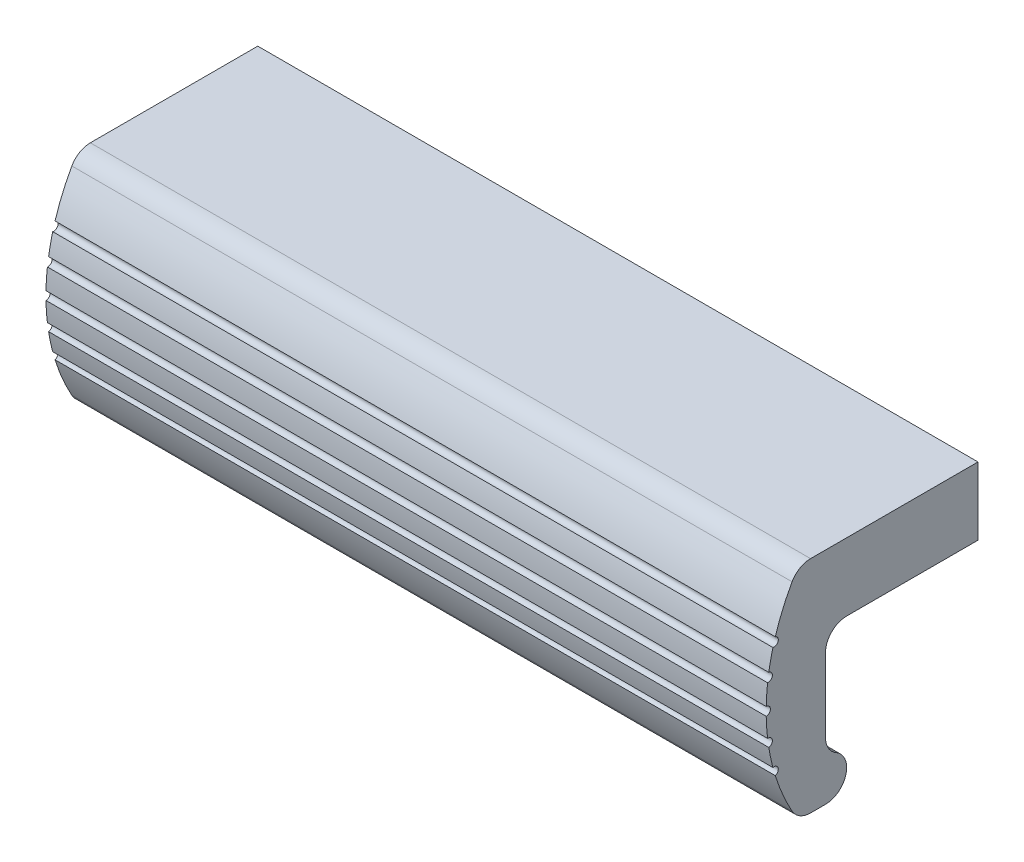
ISO-10303-21;
HEADER;
FILE_DESCRIPTION(('STEP AP214'),'2;1');
FILE_NAME('part.step','',(''),(''),'','','');
FILE_SCHEMA(('AUTOMOTIVE_DESIGN { 1 0 10303 214 1 1 1 1 }'));
ENDSEC;
DATA;
#1=APPLICATION_CONTEXT('core data for automotive mechanical design processes');
#2=APPLICATION_PROTOCOL_DEFINITION('international standard','automotive_design',2000,#1);
#3=PRODUCT_CONTEXT('',#1,'mechanical');
#4=PRODUCT('Part','Part','',(#3));
#5=PRODUCT_RELATED_PRODUCT_CATEGORY('part','',(#4));
#6=PRODUCT_DEFINITION_FORMATION('','',#4);
#7=PRODUCT_DEFINITION_CONTEXT('part definition',#1,'design');
#8=PRODUCT_DEFINITION('design','',#6,#7);
#9=PRODUCT_DEFINITION_SHAPE('','',#8);
#10=(LENGTH_UNIT() NAMED_UNIT(*) SI_UNIT(.MILLI.,.METRE.));
#11=(NAMED_UNIT(*) PLANE_ANGLE_UNIT() SI_UNIT($,.RADIAN.));
#12=(NAMED_UNIT(*) SI_UNIT($,.STERADIAN.) SOLID_ANGLE_UNIT());
#13=UNCERTAINTY_MEASURE_WITH_UNIT(LENGTH_MEASURE(1.E-05),#10,'distance_accuracy_value','');
#14=(GEOMETRIC_REPRESENTATION_CONTEXT(3) GLOBAL_UNCERTAINTY_ASSIGNED_CONTEXT((#13)) GLOBAL_UNIT_ASSIGNED_CONTEXT((#10,
#11,#12)) REPRESENTATION_CONTEXT('',''));
#15=CARTESIAN_POINT('',(0.,0.,0.));
#16=DIRECTION('',(0.,0.,1.));
#17=DIRECTION('',(1.,0.,0.));
#18=AXIS2_PLACEMENT_3D('',#15,#16,#17);
#19=CARTESIAN_POINT('',(-7.5,-4.,0.));
#20=DIRECTION('',(0.,1.,0.));
#21=DIRECTION('',(-1.,0.,0.));
#22=AXIS2_PLACEMENT_3D('',#19,#20,#21);
#23=PLANE('',#22);
#24=DIRECTION('',(1.,0.,0.));
#25=VECTOR('',#24,1.);
#26=CARTESIAN_POINT('',(-7.5,-4.,15.5));
#27=LINE('',#26,#25);
#28=CARTESIAN_POINT('',(-7.5,-4.,15.5));
#29=VERTEX_POINT('',#28);
#30=CARTESIAN_POINT('',(77.5,-4.,15.5));
#31=VERTEX_POINT('',#30);
#32=EDGE_CURVE('E9',#29,#31,#27,.T.);
#33=ORIENTED_EDGE('',*,*,#32,.F.);
#34=DIRECTION('',(0.,0.,1.));
#35=VECTOR('',#34,1.);
#36=CARTESIAN_POINT('',(-7.5,-4.,0.));
#37=LINE('',#36,#35);
#38=CARTESIAN_POINT('',(-7.5,-4.,0.));
#39=VERTEX_POINT('',#38);
#40=EDGE_CURVE('E232',#39,#29,#37,.T.);
#41=ORIENTED_EDGE('',*,*,#40,.F.);
#42=DIRECTION('',(1.,0.,0.));
#43=VECTOR('',#42,1.);
#44=CARTESIAN_POINT('',(-7.5,-4.,0.));
#45=LINE('',#44,#43);
#46=CARTESIAN_POINT('',(77.5,-4.,0.));
#47=VERTEX_POINT('',#46);
#48=EDGE_CURVE('E29',#39,#47,#45,.T.);
#49=ORIENTED_EDGE('',*,*,#48,.T.);
#50=DIRECTION('',(0.,0.,1.));
#51=VECTOR('',#50,1.);
#52=CARTESIAN_POINT('',(77.5,-4.,0.));
#53=LINE('',#52,#51);
#54=EDGE_CURVE('E167',#47,#31,#53,.T.);
#55=ORIENTED_EDGE('',*,*,#54,.T.);
#56=EDGE_LOOP('',(#33,#41,#49,#55));
#57=FACE_BOUND('',#56,.T.);
#58=ADVANCED_FACE('F14',(#57),#23,.F.);
#59=CARTESIAN_POINT('',(-7.5,-6.5,15.5));
#60=DIRECTION('',(1.,0.,0.));
#61=DIRECTION('',(0.,0.,-1.));
#62=AXIS2_PLACEMENT_3D('',#59,#60,#61);
#63=CYLINDRICAL_SURFACE('',#62,2.5);
#64=DIRECTION('',(1.,0.,0.));
#65=VECTOR('',#64,1.);
#66=CARTESIAN_POINT('',(-7.5,-6.5,18.));
#67=LINE('',#66,#65);
#68=CARTESIAN_POINT('',(-7.5,-6.5,18.));
#69=VERTEX_POINT('',#68);
#70=CARTESIAN_POINT('',(77.5,-6.5,18.));
#71=VERTEX_POINT('',#70);
#72=EDGE_CURVE('E22',#69,#71,#67,.T.);
#73=ORIENTED_EDGE('',*,*,#72,.F.);
#74=CARTESIAN_POINT('',(-7.5,-6.5,15.5));
#75=DIRECTION('',(-1.,0.,0.));
#76=DIRECTION('',(0.,0.,1.));
#77=AXIS2_PLACEMENT_3D('',#74,#75,#76);
#78=CIRCLE('',#77,2.5);
#79=EDGE_CURVE('E163',#69,#29,#78,.T.);
#80=ORIENTED_EDGE('',*,*,#79,.T.);
#81=ORIENTED_EDGE('',*,*,#32,.T.);
#82=CARTESIAN_POINT('',(77.5,-6.5,15.5));
#83=DIRECTION('',(-1.,0.,0.));
#84=DIRECTION('',(0.,0.,1.));
#85=AXIS2_PLACEMENT_3D('',#82,#83,#84);
#86=CIRCLE('',#85,2.5);
#87=EDGE_CURVE('E160',#71,#31,#86,.T.);
#88=ORIENTED_EDGE('',*,*,#87,.F.);
#89=EDGE_LOOP('',(#73,#80,#81,#88));
#90=FACE_BOUND('',#89,.T.);
#91=ADVANCED_FACE('F16',(#90),#63,.F.);
#92=CARTESIAN_POINT('',(-7.5,-6.5,18.));
#93=DIRECTION('',(0.,0.,1.));
#94=DIRECTION('',(1.,0.,0.));
#95=AXIS2_PLACEMENT_3D('',#92,#93,#94);
#96=PLANE('',#95);
#97=DIRECTION('',(1.,0.,0.));
#98=VECTOR('',#97,1.);
#99=CARTESIAN_POINT('',(-7.5,-15.1698729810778,18.));
#100=LINE('',#99,#98);
#101=CARTESIAN_POINT('',(-7.5,-15.1698729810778,18.));
#102=VERTEX_POINT('',#101);
#103=CARTESIAN_POINT('',(77.5,-15.1698729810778,18.));
#104=VERTEX_POINT('',#103);
#105=EDGE_CURVE('E324',#102,#104,#100,.T.);
#106=ORIENTED_EDGE('',*,*,#105,.F.);
#107=DIRECTION('',(0.,-1.,0.));
#108=VECTOR('',#107,1.);
#109=CARTESIAN_POINT('',(-7.5,-6.5,18.));
#110=LINE('',#109,#108);
#111=EDGE_CURVE('E235',#69,#102,#110,.T.);
#112=ORIENTED_EDGE('',*,*,#111,.F.);
#113=ORIENTED_EDGE('',*,*,#72,.T.);
#114=DIRECTION('',(0.,-1.,0.));
#115=VECTOR('',#114,1.);
#116=CARTESIAN_POINT('',(77.5,-6.5,18.));
#117=LINE('',#116,#115);
#118=EDGE_CURVE('E175',#71,#104,#117,.T.);
#119=ORIENTED_EDGE('',*,*,#118,.T.);
#120=EDGE_LOOP('',(#106,#112,#113,#119));
#121=FACE_BOUND('',#120,.T.);
#122=ADVANCED_FACE('F327',(#121),#96,.F.);
#123=CARTESIAN_POINT('',(-7.5,-15.1698729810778,15.5));
#124=DIRECTION('',(1.,0.,0.));
#125=DIRECTION('',(0.,0.,-1.));
#126=AXIS2_PLACEMENT_3D('',#123,#124,#125);
#127=CYLINDRICAL_SURFACE('',#126,2.5);
#128=DIRECTION('',(1.,0.,0.));
#129=VECTOR('',#128,1.);
#130=CARTESIAN_POINT('',(-7.5,-17.334936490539,16.75));
#131=LINE('',#130,#129);
#132=CARTESIAN_POINT('',(-7.5,-17.334936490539,16.75));
#133=VERTEX_POINT('',#132);
#134=CARTESIAN_POINT('',(77.5,-17.334936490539,16.75));
#135=VERTEX_POINT('',#134);
#136=EDGE_CURVE('E322',#133,#135,#131,.T.);
#137=ORIENTED_EDGE('',*,*,#136,.F.);
#138=CARTESIAN_POINT('',(-7.5,-15.1698729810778,15.5));
#139=DIRECTION('',(-1.,0.,0.));
#140=DIRECTION('',(0.,0.,1.));
#141=AXIS2_PLACEMENT_3D('',#138,#139,#140);
#142=CIRCLE('',#141,2.5);
#143=EDGE_CURVE('E238',#133,#102,#142,.T.);
#144=ORIENTED_EDGE('',*,*,#143,.T.);
#145=ORIENTED_EDGE('',*,*,#105,.T.);
#146=CARTESIAN_POINT('',(77.5,-15.1698729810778,15.5));
#147=DIRECTION('',(-1.,0.,0.));
#148=DIRECTION('',(0.,0.,1.));
#149=AXIS2_PLACEMENT_3D('',#146,#147,#148);
#150=CIRCLE('',#149,2.5);
#151=EDGE_CURVE('E177',#135,#104,#150,.T.);
#152=ORIENTED_EDGE('',*,*,#151,.F.);
#153=EDGE_LOOP('',(#137,#144,#145,#152));
#154=FACE_BOUND('',#153,.T.);
#155=ADVANCED_FACE('F396',(#154),#127,.F.);
#156=CARTESIAN_POINT('',(-7.5,-19.5,18.));
#157=DIRECTION('',(1.,0.,0.));
#158=DIRECTION('',(0.,0.,-1.));
#159=AXIS2_PLACEMENT_3D('',#156,#157,#158);
#160=CYLINDRICAL_SURFACE('',#159,2.5);
#161=DIRECTION('',(1.,0.,0.));
#162=VECTOR('',#161,1.);
#163=CARTESIAN_POINT('',(-7.5,-22.,18.));
#164=LINE('',#163,#162);
#165=CARTESIAN_POINT('',(-7.5,-22.,18.));
#166=VERTEX_POINT('',#165);
#167=CARTESIAN_POINT('',(77.5,-22.,18.));
#168=VERTEX_POINT('',#167);
#169=EDGE_CURVE('E320',#166,#168,#164,.T.);
#170=ORIENTED_EDGE('',*,*,#169,.F.);
#171=CARTESIAN_POINT('',(-7.5,-19.5,18.));
#172=DIRECTION('',(-1.,0.,0.));
#173=DIRECTION('',(0.,0.,1.));
#174=AXIS2_PLACEMENT_3D('',#171,#172,#173);
#175=CIRCLE('',#174,2.5);
#176=EDGE_CURVE('E241',#133,#166,#175,.T.);
#177=ORIENTED_EDGE('',*,*,#176,.F.);
#178=ORIENTED_EDGE('',*,*,#136,.T.);
#179=CARTESIAN_POINT('',(77.5,-19.5,18.));
#180=DIRECTION('',(-1.,0.,0.));
#181=DIRECTION('',(0.,0.,1.));
#182=AXIS2_PLACEMENT_3D('',#179,#180,#181);
#183=CIRCLE('',#182,2.5);
#184=EDGE_CURVE('E182',#135,#168,#183,.T.);
#185=ORIENTED_EDGE('',*,*,#184,.T.);
#186=EDGE_LOOP('',(#170,#177,#178,#185));
#187=FACE_BOUND('',#186,.T.);
#188=ADVANCED_FACE('F393',(#187),#160,.T.);
#189=CARTESIAN_POINT('',(-7.5,-22.,18.));
#190=DIRECTION('',(0.,1.,0.));
#191=DIRECTION('',(-1.,0.,0.));
#192=AXIS2_PLACEMENT_3D('',#189,#190,#191);
#193=PLANE('',#192);
#194=DIRECTION('',(1.,0.,0.));
#195=VECTOR('',#194,1.);
#196=CARTESIAN_POINT('',(-7.5,-22.,19.7616630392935));
#197=LINE('',#196,#195);
#198=CARTESIAN_POINT('',(-7.5,-22.,19.7616630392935));
#199=VERTEX_POINT('',#198);
#200=CARTESIAN_POINT('',(77.5,-22.,19.7616630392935));
#201=VERTEX_POINT('',#200);
#202=EDGE_CURVE('E318',#199,#201,#197,.T.);
#203=ORIENTED_EDGE('',*,*,#202,.F.);
#204=DIRECTION('',(0.,0.,1.));
#205=VECTOR('',#204,1.);
#206=CARTESIAN_POINT('',(-7.5,-22.,18.));
#207=LINE('',#206,#205);
#208=EDGE_CURVE('E244',#166,#199,#207,.T.);
#209=ORIENTED_EDGE('',*,*,#208,.F.);
#210=ORIENTED_EDGE('',*,*,#169,.T.);
#211=DIRECTION('',(0.,0.,1.));
#212=VECTOR('',#211,1.);
#213=CARTESIAN_POINT('',(77.5,-22.,18.));
#214=LINE('',#213,#212);
#215=EDGE_CURVE('E185',#168,#201,#214,.T.);
#216=ORIENTED_EDGE('',*,*,#215,.T.);
#217=EDGE_LOOP('',(#203,#209,#210,#216));
#218=FACE_BOUND('',#217,.T.);
#219=ADVANCED_FACE('F390',(#218),#193,.F.);
#220=CARTESIAN_POINT('',(-7.5,-19.5,19.7616630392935));
#221=DIRECTION('',(1.,0.,0.));
#222=DIRECTION('',(0.,0.,-1.));
#223=AXIS2_PLACEMENT_3D('',#220,#221,#222);
#224=CYLINDRICAL_SURFACE('',#223,2.5);
#225=DIRECTION('',(1.,0.,0.));
#226=VECTOR('',#225,1.);
#227=CARTESIAN_POINT('',(-7.5,-20.720930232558,21.943251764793));
#228=LINE('',#227,#226);
#229=CARTESIAN_POINT('',(-7.5,-20.720930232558,21.943251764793));
#230=VERTEX_POINT('',#229);
#231=CARTESIAN_POINT('',(77.5,-20.720930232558,21.943251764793));
#232=VERTEX_POINT('',#231);
#233=EDGE_CURVE('E316',#230,#232,#228,.T.);
#234=ORIENTED_EDGE('',*,*,#233,.F.);
#235=CARTESIAN_POINT('',(-7.5,-19.5,19.7616630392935));
#236=DIRECTION('',(-1.,0.,0.));
#237=DIRECTION('',(0.,0.,1.));
#238=AXIS2_PLACEMENT_3D('',#235,#236,#237);
#239=CIRCLE('',#238,2.5);
#240=EDGE_CURVE('E247',#199,#230,#239,.T.);
#241=ORIENTED_EDGE('',*,*,#240,.F.);
#242=ORIENTED_EDGE('',*,*,#202,.T.);
#243=CARTESIAN_POINT('',(77.5,-19.5,19.7616630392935));
#244=DIRECTION('',(-1.,0.,0.));
#245=DIRECTION('',(0.,0.,1.));
#246=AXIS2_PLACEMENT_3D('',#243,#244,#245);
#247=CIRCLE('',#246,2.5);
#248=EDGE_CURVE('E188',#201,#232,#247,.T.);
#249=ORIENTED_EDGE('',*,*,#248,.T.);
#250=EDGE_LOOP('',(#234,#241,#242,#249));
#251=FACE_BOUND('',#250,.T.);
#252=ADVANCED_FACE('F386',(#251),#224,.T.);
#253=CARTESIAN_POINT('',(-7.5,-9.,1.));
#254=DIRECTION('',(1.,0.,0.));
#255=DIRECTION('',(0.,0.,-1.));
#256=AXIS2_PLACEMENT_3D('',#253,#254,#255);
#257=CYLINDRICAL_SURFACE('',#256,24.);
#258=DIRECTION('',(1.,0.,0.));
#259=VECTOR('',#258,1.);
#260=CARTESIAN_POINT('',(-7.5,-16.094465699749,23.9274629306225));
#261=LINE('',#260,#259);
#262=CARTESIAN_POINT('',(-7.5,-16.094465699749,23.9274629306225));
#263=VERTEX_POINT('',#262);
#264=CARTESIAN_POINT('',(77.5,-16.094465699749,23.9274629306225));
#265=VERTEX_POINT('',#264);
#266=EDGE_CURVE('E314',#263,#265,#261,.T.);
#267=ORIENTED_EDGE('',*,*,#266,.F.);
#268=CARTESIAN_POINT('',(-7.5,-9.,1.));
#269=DIRECTION('',(-1.,0.,0.));
#270=DIRECTION('',(0.,0.,1.));
#271=AXIS2_PLACEMENT_3D('',#268,#269,#270);
#272=CIRCLE('',#271,24.);
#273=EDGE_CURVE('E250',#230,#263,#272,.T.);
#274=ORIENTED_EDGE('',*,*,#273,.F.);
#275=ORIENTED_EDGE('',*,*,#233,.T.);
#276=CARTESIAN_POINT('',(77.5,-9.,1.));
#277=DIRECTION('',(-1.,0.,0.));
#278=DIRECTION('',(0.,0.,1.));
#279=AXIS2_PLACEMENT_3D('',#276,#277,#278);
#280=CIRCLE('',#279,24.);
#281=EDGE_CURVE('E191',#232,#265,#280,.T.);
#282=ORIENTED_EDGE('',*,*,#281,.T.);
#283=EDGE_LOOP('',(#267,#274,#275,#282));
#284=FACE_BOUND('',#283,.T.);
#285=ADVANCED_FACE('F381',(#284),#257,.T.);
#286=CARTESIAN_POINT('',(-7.5,-15.615296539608,24.0702807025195));
#287=DIRECTION('',(1.,0.,0.));
#288=DIRECTION('',(0.,0.,-1.));
#289=AXIS2_PLACEMENT_3D('',#286,#287,#288);
#290=CYLINDRICAL_SURFACE('',#289,0.5);
#291=DIRECTION('',(1.,0.,0.));
#292=VECTOR('',#291,1.);
#293=CARTESIAN_POINT('',(-7.5,-15.1332561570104,24.2030853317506));
#294=LINE('',#293,#292);
#295=CARTESIAN_POINT('',(-7.5,-15.1332561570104,24.2030853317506));
#296=VERTEX_POINT('',#295);
#297=CARTESIAN_POINT('',(77.5,-15.1332561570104,24.2030853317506));
#298=VERTEX_POINT('',#297);
#299=EDGE_CURVE('E312',#296,#298,#294,.T.);
#300=ORIENTED_EDGE('',*,*,#299,.F.);
#301=CARTESIAN_POINT('',(-7.5,-15.615296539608,24.0702807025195));
#302=DIRECTION('',(-1.,0.,0.));
#303=DIRECTION('',(0.,0.,1.));
#304=AXIS2_PLACEMENT_3D('',#301,#302,#303);
#305=CIRCLE('',#304,0.5);
#306=EDGE_CURVE('E253',#296,#263,#305,.T.);
#307=ORIENTED_EDGE('',*,*,#306,.T.);
#308=ORIENTED_EDGE('',*,*,#266,.T.);
#309=CARTESIAN_POINT('',(77.5,-15.615296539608,24.0702807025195));
#310=DIRECTION('',(-1.,0.,0.));
#311=DIRECTION('',(0.,0.,1.));
#312=AXIS2_PLACEMENT_3D('',#309,#310,#311);
#313=CIRCLE('',#312,0.5);
#314=EDGE_CURVE('E194',#298,#265,#313,.T.);
#315=ORIENTED_EDGE('',*,*,#314,.F.);
#316=EDGE_LOOP('',(#300,#307,#308,#315));
#317=FACE_BOUND('',#316,.T.);
#318=ADVANCED_FACE('F378',(#317),#290,.F.);
#319=CARTESIAN_POINT('',(-7.5,-9.,1.));
#320=DIRECTION('',(1.,0.,0.));
#321=DIRECTION('',(0.,0.,-1.));
#322=AXIS2_PLACEMENT_3D('',#319,#320,#321);
#323=CYLINDRICAL_SURFACE('',#322,24.);
#324=DIRECTION('',(1.,0.,0.));
#325=VECTOR('',#324,1.);
#326=CARTESIAN_POINT('',(-7.5,-12.8345367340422,24.6916932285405));
#327=LINE('',#326,#325);
#328=CARTESIAN_POINT('',(-7.5,-12.8345367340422,24.6916932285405));
#329=VERTEX_POINT('',#328);
#330=CARTESIAN_POINT('',(77.5,-12.8345367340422,24.6916932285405));
#331=VERTEX_POINT('',#330);
#332=EDGE_CURVE('E310',#329,#331,#327,.T.);
#333=ORIENTED_EDGE('',*,*,#332,.F.);
#334=CARTESIAN_POINT('',(-7.5,-9.,1.));
#335=DIRECTION('',(-1.,0.,0.));
#336=DIRECTION('',(0.,0.,1.));
#337=AXIS2_PLACEMENT_3D('',#334,#335,#336);
#338=CIRCLE('',#337,24.);
#339=EDGE_CURVE('E256',#296,#329,#338,.T.);
#340=ORIENTED_EDGE('',*,*,#339,.F.);
#341=ORIENTED_EDGE('',*,*,#299,.T.);
#342=CARTESIAN_POINT('',(77.5,-9.,1.));
#343=DIRECTION('',(-1.,0.,0.));
#344=DIRECTION('',(0.,0.,1.));
#345=AXIS2_PLACEMENT_3D('',#342,#343,#344);
#346=CIRCLE('',#345,24.);
#347=EDGE_CURVE('E197',#298,#331,#346,.T.);
#348=ORIENTED_EDGE('',*,*,#347,.T.);
#349=EDGE_LOOP('',(#333,#340,#341,#348));
#350=FACE_BOUND('',#349,.T.);
#351=ADVANCED_FACE('F374',(#350),#323,.T.);
#352=CARTESIAN_POINT('',(-7.5,-12.3401544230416,24.7664336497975));
#353=DIRECTION('',(1.,0.,0.));
#354=DIRECTION('',(0.,0.,-1.));
#355=AXIS2_PLACEMENT_3D('',#352,#353,#354);
#356=CYLINDRICAL_SURFACE('',#355,0.5);
#357=DIRECTION('',(1.,0.,0.));
#358=VECTOR('',#357,1.);
#359=CARTESIAN_POINT('',(-7.5,-11.8443223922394,24.830858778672));
#360=LINE('',#359,#358);
#361=CARTESIAN_POINT('',(-7.5,-11.8443223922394,24.830858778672));
#362=VERTEX_POINT('',#361);
#363=CARTESIAN_POINT('',(77.5,-11.8443223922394,24.830858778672));
#364=VERTEX_POINT('',#363);
#365=EDGE_CURVE('E308',#362,#364,#360,.T.);
#366=ORIENTED_EDGE('',*,*,#365,.F.);
#367=CARTESIAN_POINT('',(-7.5,-12.3401544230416,24.7664336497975));
#368=DIRECTION('',(-1.,0.,0.));
#369=DIRECTION('',(0.,0.,1.));
#370=AXIS2_PLACEMENT_3D('',#367,#368,#369);
#371=CIRCLE('',#370,0.5);
#372=EDGE_CURVE('E259',#362,#329,#371,.T.);
#373=ORIENTED_EDGE('',*,*,#372,.T.);
#374=ORIENTED_EDGE('',*,*,#332,.T.);
#375=CARTESIAN_POINT('',(77.5,-12.3401544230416,24.7664336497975));
#376=DIRECTION('',(-1.,0.,0.));
#377=DIRECTION('',(0.,0.,1.));
#378=AXIS2_PLACEMENT_3D('',#375,#376,#377);
#379=CIRCLE('',#378,0.5);
#380=EDGE_CURVE('E200',#364,#331,#379,.T.);
#381=ORIENTED_EDGE('',*,*,#380,.F.);
#382=EDGE_LOOP('',(#366,#373,#374,#381));
#383=FACE_BOUND('',#382,.T.);
#384=ADVANCED_FACE('F369',(#383),#356,.F.);
#385=CARTESIAN_POINT('',(-7.5,-9.,1.));
#386=DIRECTION('',(1.,0.,0.));
#387=DIRECTION('',(0.,0.,-1.));
#388=AXIS2_PLACEMENT_3D('',#385,#386,#387);
#389=CYLINDRICAL_SURFACE('',#388,24.);
#390=DIRECTION('',(1.,0.,0.));
#391=VECTOR('',#390,1.);
#392=CARTESIAN_POINT('',(-7.5,-9.49997287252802,24.9947916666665));
#393=LINE('',#392,#391);
#394=CARTESIAN_POINT('',(-7.5,-9.49997287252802,24.9947916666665));
#395=VERTEX_POINT('',#394);
#396=CARTESIAN_POINT('',(77.5,-9.49997287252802,24.9947916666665));
#397=VERTEX_POINT('',#396);
#398=EDGE_CURVE('E306',#395,#397,#393,.T.);
#399=ORIENTED_EDGE('',*,*,#398,.F.);
#400=CARTESIAN_POINT('',(-7.5,-9.,1.));
#401=DIRECTION('',(-1.,0.,0.));
#402=DIRECTION('',(0.,0.,1.));
#403=AXIS2_PLACEMENT_3D('',#400,#401,#402);
#404=CIRCLE('',#403,24.);
#405=EDGE_CURVE('E262',#362,#395,#404,.T.);
#406=ORIENTED_EDGE('',*,*,#405,.F.);
#407=ORIENTED_EDGE('',*,*,#365,.T.);
#408=CARTESIAN_POINT('',(77.5,-9.,1.));
#409=DIRECTION('',(-1.,0.,0.));
#410=DIRECTION('',(0.,0.,1.));
#411=AXIS2_PLACEMENT_3D('',#408,#409,#410);
#412=CIRCLE('',#411,24.);
#413=EDGE_CURVE('E203',#364,#397,#412,.T.);
#414=ORIENTED_EDGE('',*,*,#413,.T.);
#415=EDGE_LOOP('',(#399,#406,#407,#414));
#416=FACE_BOUND('',#415,.T.);
#417=ADVANCED_FACE('F365',(#416),#389,.T.);
#418=CARTESIAN_POINT('',(-7.5,-9.,25.));
#419=DIRECTION('',(1.,0.,0.));
#420=DIRECTION('',(0.,0.,-1.));
#421=AXIS2_PLACEMENT_3D('',#418,#419,#420);
#422=CYLINDRICAL_SURFACE('',#421,0.500000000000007);
#423=DIRECTION('',(1.,0.,0.));
#424=VECTOR('',#423,1.);
#425=CARTESIAN_POINT('',(-7.5,-8.50002712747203,24.9947916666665));
#426=LINE('',#425,#424);
#427=CARTESIAN_POINT('',(-7.5,-8.50002712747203,24.9947916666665));
#428=VERTEX_POINT('',#427);
#429=CARTESIAN_POINT('',(77.5,-8.50002712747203,24.9947916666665));
#430=VERTEX_POINT('',#429);
#431=EDGE_CURVE('E304',#428,#430,#426,.T.);
#432=ORIENTED_EDGE('',*,*,#431,.F.);
#433=CARTESIAN_POINT('',(-7.5,-9.,25.));
#434=DIRECTION('',(-1.,0.,0.));
#435=DIRECTION('',(0.,0.,1.));
#436=AXIS2_PLACEMENT_3D('',#433,#434,#435);
#437=CIRCLE('',#436,0.500000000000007);
#438=EDGE_CURVE('E265',#428,#395,#437,.T.);
#439=ORIENTED_EDGE('',*,*,#438,.T.);
#440=ORIENTED_EDGE('',*,*,#398,.T.);
#441=CARTESIAN_POINT('',(77.5,-9.,25.));
#442=DIRECTION('',(-1.,0.,0.));
#443=DIRECTION('',(0.,0.,1.));
#444=AXIS2_PLACEMENT_3D('',#441,#442,#443);
#445=CIRCLE('',#444,0.500000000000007);
#446=EDGE_CURVE('E206',#430,#397,#445,.T.);
#447=ORIENTED_EDGE('',*,*,#446,.F.);
#448=EDGE_LOOP('',(#432,#439,#440,#447));
#449=FACE_BOUND('',#448,.T.);
#450=ADVANCED_FACE('F361',(#449),#422,.F.);
#451=CARTESIAN_POINT('',(-7.5,-9.,1.));
#452=DIRECTION('',(1.,0.,0.));
#453=DIRECTION('',(0.,0.,-1.));
#454=AXIS2_PLACEMENT_3D('',#451,#452,#453);
#455=CYLINDRICAL_SURFACE('',#454,24.);
#456=DIRECTION('',(1.,0.,0.));
#457=VECTOR('',#456,1.);
#458=CARTESIAN_POINT('',(-7.5,-6.15567760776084,24.830858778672));
#459=LINE('',#458,#457);
#460=CARTESIAN_POINT('',(-7.5,-6.15567760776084,24.830858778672));
#461=VERTEX_POINT('',#460);
#462=CARTESIAN_POINT('',(77.5,-6.15567760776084,24.830858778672));
#463=VERTEX_POINT('',#462);
#464=EDGE_CURVE('E302',#461,#463,#459,.T.);
#465=ORIENTED_EDGE('',*,*,#464,.F.);
#466=CARTESIAN_POINT('',(-7.5,-9.,1.));
#467=DIRECTION('',(-1.,0.,0.));
#468=DIRECTION('',(0.,0.,1.));
#469=AXIS2_PLACEMENT_3D('',#466,#467,#468);
#470=CIRCLE('',#469,24.);
#471=EDGE_CURVE('E268',#428,#461,#470,.T.);
#472=ORIENTED_EDGE('',*,*,#471,.F.);
#473=ORIENTED_EDGE('',*,*,#431,.T.);
#474=CARTESIAN_POINT('',(77.5,-9.,1.));
#475=DIRECTION('',(-1.,0.,0.));
#476=DIRECTION('',(0.,0.,1.));
#477=AXIS2_PLACEMENT_3D('',#474,#475,#476);
#478=CIRCLE('',#477,24.);
#479=EDGE_CURVE('E209',#430,#463,#478,.T.);
#480=ORIENTED_EDGE('',*,*,#479,.T.);
#481=EDGE_LOOP('',(#465,#472,#473,#480));
#482=FACE_BOUND('',#481,.T.);
#483=ADVANCED_FACE('F357',(#482),#455,.T.);
#484=CARTESIAN_POINT('',(-7.5,-5.65984557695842,24.7664336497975));
#485=DIRECTION('',(1.,0.,0.));
#486=DIRECTION('',(0.,0.,-1.));
#487=AXIS2_PLACEMENT_3D('',#484,#485,#486);
#488=CYLINDRICAL_SURFACE('',#487,0.499999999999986);
#489=DIRECTION('',(1.,0.,0.));
#490=VECTOR('',#489,1.);
#491=CARTESIAN_POINT('',(-7.5,-5.16546326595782,24.6916932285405));
#492=LINE('',#491,#490);
#493=CARTESIAN_POINT('',(-7.5,-5.16546326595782,24.6916932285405));
#494=VERTEX_POINT('',#493);
#495=CARTESIAN_POINT('',(77.5,-5.16546326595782,24.6916932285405));
#496=VERTEX_POINT('',#495);
#497=EDGE_CURVE('E300',#494,#496,#492,.T.);
#498=ORIENTED_EDGE('',*,*,#497,.F.);
#499=CARTESIAN_POINT('',(-7.5,-5.65984557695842,24.7664336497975));
#500=DIRECTION('',(-1.,0.,0.));
#501=DIRECTION('',(0.,0.,1.));
#502=AXIS2_PLACEMENT_3D('',#499,#500,#501);
#503=CIRCLE('',#502,0.499999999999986);
#504=EDGE_CURVE('E271',#494,#461,#503,.T.);
#505=ORIENTED_EDGE('',*,*,#504,.T.);
#506=ORIENTED_EDGE('',*,*,#464,.T.);
#507=CARTESIAN_POINT('',(77.5,-5.65984557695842,24.7664336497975));
#508=DIRECTION('',(-1.,0.,0.));
#509=DIRECTION('',(0.,0.,1.));
#510=AXIS2_PLACEMENT_3D('',#507,#508,#509);
#511=CIRCLE('',#510,0.499999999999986);
#512=EDGE_CURVE('E212',#496,#463,#511,.T.);
#513=ORIENTED_EDGE('',*,*,#512,.F.);
#514=EDGE_LOOP('',(#498,#505,#506,#513));
#515=FACE_BOUND('',#514,.T.);
#516=ADVANCED_FACE('F354',(#515),#488,.F.);
#517=CARTESIAN_POINT('',(-7.5,-9.,1.));
#518=DIRECTION('',(1.,0.,0.));
#519=DIRECTION('',(0.,0.,-1.));
#520=AXIS2_PLACEMENT_3D('',#517,#518,#519);
#521=CYLINDRICAL_SURFACE('',#520,24.);
#522=DIRECTION('',(1.,0.,0.));
#523=VECTOR('',#522,1.);
#524=CARTESIAN_POINT('',(-7.5,-2.8667438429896,24.2030853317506));
#525=LINE('',#524,#523);
#526=CARTESIAN_POINT('',(-7.5,-2.8667438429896,24.2030853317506));
#527=VERTEX_POINT('',#526);
#528=CARTESIAN_POINT('',(77.5,-2.8667438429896,24.2030853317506));
#529=VERTEX_POINT('',#528);
#530=EDGE_CURVE('E298',#527,#529,#525,.T.);
#531=ORIENTED_EDGE('',*,*,#530,.F.);
#532=CARTESIAN_POINT('',(-7.5,-9.,1.));
#533=DIRECTION('',(-1.,0.,0.));
#534=DIRECTION('',(0.,0.,1.));
#535=AXIS2_PLACEMENT_3D('',#532,#533,#534);
#536=CIRCLE('',#535,24.);
#537=EDGE_CURVE('E274',#494,#527,#536,.T.);
#538=ORIENTED_EDGE('',*,*,#537,.F.);
#539=ORIENTED_EDGE('',*,*,#497,.T.);
#540=CARTESIAN_POINT('',(77.5,-9.,1.));
#541=DIRECTION('',(-1.,0.,0.));
#542=DIRECTION('',(0.,0.,1.));
#543=AXIS2_PLACEMENT_3D('',#540,#541,#542);
#544=CIRCLE('',#543,24.);
#545=EDGE_CURVE('E215',#496,#529,#544,.T.);
#546=ORIENTED_EDGE('',*,*,#545,.T.);
#547=EDGE_LOOP('',(#531,#538,#539,#546));
#548=FACE_BOUND('',#547,.T.);
#549=ADVANCED_FACE('F350',(#548),#521,.T.);
#550=CARTESIAN_POINT('',(-7.5,-2.38470346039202,24.0702807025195));
#551=DIRECTION('',(1.,0.,0.));
#552=DIRECTION('',(0.,0.,-1.));
#553=AXIS2_PLACEMENT_3D('',#550,#551,#552);
#554=CYLINDRICAL_SURFACE('',#553,0.500000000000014);
#555=DIRECTION('',(1.,0.,0.));
#556=VECTOR('',#555,1.);
#557=CARTESIAN_POINT('',(-7.5,-1.90553430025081,23.9274629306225));
#558=LINE('',#557,#556);
#559=CARTESIAN_POINT('',(-7.5,-1.90553430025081,23.9274629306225));
#560=VERTEX_POINT('',#559);
#561=CARTESIAN_POINT('',(77.5,-1.90553430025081,23.9274629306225));
#562=VERTEX_POINT('',#561);
#563=EDGE_CURVE('E296',#560,#562,#558,.T.);
#564=ORIENTED_EDGE('',*,*,#563,.F.);
#565=CARTESIAN_POINT('',(-7.5,-2.38470346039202,24.0702807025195));
#566=DIRECTION('',(-1.,0.,0.));
#567=DIRECTION('',(0.,0.,1.));
#568=AXIS2_PLACEMENT_3D('',#565,#566,#567);
#569=CIRCLE('',#568,0.500000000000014);
#570=EDGE_CURVE('E277',#560,#527,#569,.T.);
#571=ORIENTED_EDGE('',*,*,#570,.T.);
#572=ORIENTED_EDGE('',*,*,#530,.T.);
#573=CARTESIAN_POINT('',(77.5,-2.38470346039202,24.0702807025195));
#574=DIRECTION('',(-1.,0.,0.));
#575=DIRECTION('',(0.,0.,1.));
#576=AXIS2_PLACEMENT_3D('',#573,#574,#575);
#577=CIRCLE('',#576,0.500000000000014);
#578=EDGE_CURVE('E218',#562,#529,#577,.T.);
#579=ORIENTED_EDGE('',*,*,#578,.F.);
#580=EDGE_LOOP('',(#564,#571,#572,#579));
#581=FACE_BOUND('',#580,.T.);
#582=ADVANCED_FACE('F345',(#581),#554,.F.);
#583=CARTESIAN_POINT('',(-7.5,-9.,1.));
#584=DIRECTION('',(1.,0.,0.));
#585=DIRECTION('',(0.,0.,-1.));
#586=AXIS2_PLACEMENT_3D('',#583,#584,#585);
#587=CYLINDRICAL_SURFACE('',#586,24.);
#588=DIRECTION('',(1.,0.,0.));
#589=VECTOR('',#588,1.);
#590=CARTESIAN_POINT('',(-7.5,2.72093023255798,21.943251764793));
#591=LINE('',#590,#589);
#592=CARTESIAN_POINT('',(-7.5,2.72093023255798,21.943251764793));
#593=VERTEX_POINT('',#592);
#594=CARTESIAN_POINT('',(77.5,2.72093023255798,21.943251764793));
#595=VERTEX_POINT('',#594);
#596=EDGE_CURVE('E294',#593,#595,#591,.T.);
#597=ORIENTED_EDGE('',*,*,#596,.F.);
#598=CARTESIAN_POINT('',(-7.5,-9.,1.));
#599=DIRECTION('',(-1.,0.,0.));
#600=DIRECTION('',(0.,0.,1.));
#601=AXIS2_PLACEMENT_3D('',#598,#599,#600);
#602=CIRCLE('',#601,24.);
#603=EDGE_CURVE('E280',#560,#593,#602,.T.);
#604=ORIENTED_EDGE('',*,*,#603,.F.);
#605=ORIENTED_EDGE('',*,*,#563,.T.);
#606=CARTESIAN_POINT('',(77.5,-9.,1.));
#607=DIRECTION('',(-1.,0.,0.));
#608=DIRECTION('',(0.,0.,1.));
#609=AXIS2_PLACEMENT_3D('',#606,#607,#608);
#610=CIRCLE('',#609,24.);
#611=EDGE_CURVE('E221',#562,#595,#610,.T.);
#612=ORIENTED_EDGE('',*,*,#611,.T.);
#613=EDGE_LOOP('',(#597,#604,#605,#612));
#614=FACE_BOUND('',#613,.T.);
#615=ADVANCED_FACE('F341',(#614),#587,.T.);
#616=CARTESIAN_POINT('',(-7.5,1.5,19.7616630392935));
#617=DIRECTION('',(1.,0.,0.));
#618=DIRECTION('',(0.,0.,-1.));
#619=AXIS2_PLACEMENT_3D('',#616,#617,#618);
#620=CYLINDRICAL_SURFACE('',#619,2.5);
#621=DIRECTION('',(1.,0.,0.));
#622=VECTOR('',#621,1.);
#623=CARTESIAN_POINT('',(-7.5,4.,19.7616630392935));
#624=LINE('',#623,#622);
#625=CARTESIAN_POINT('',(-7.5,4.,19.7616630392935));
#626=VERTEX_POINT('',#625);
#627=CARTESIAN_POINT('',(77.5,4.,19.7616630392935));
#628=VERTEX_POINT('',#627);
#629=EDGE_CURVE('E292',#626,#628,#624,.T.);
#630=ORIENTED_EDGE('',*,*,#629,.F.);
#631=CARTESIAN_POINT('',(-7.5,1.5,19.7616630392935));
#632=DIRECTION('',(-1.,0.,0.));
#633=DIRECTION('',(0.,0.,1.));
#634=AXIS2_PLACEMENT_3D('',#631,#632,#633);
#635=CIRCLE('',#634,2.5);
#636=EDGE_CURVE('E283',#593,#626,#635,.T.);
#637=ORIENTED_EDGE('',*,*,#636,.F.);
#638=ORIENTED_EDGE('',*,*,#596,.T.);
#639=CARTESIAN_POINT('',(77.5,1.5,19.7616630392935));
#640=DIRECTION('',(-1.,0.,0.));
#641=DIRECTION('',(0.,0.,1.));
#642=AXIS2_PLACEMENT_3D('',#639,#640,#641);
#643=CIRCLE('',#642,2.5);
#644=EDGE_CURVE('E224',#595,#628,#643,.T.);
#645=ORIENTED_EDGE('',*,*,#644,.T.);
#646=EDGE_LOOP('',(#630,#637,#638,#645));
#647=FACE_BOUND('',#646,.T.);
#648=ADVANCED_FACE('F337',(#647),#620,.T.);
#649=CARTESIAN_POINT('',(-7.5,4.,0.));
#650=DIRECTION('',(0.,1.,0.));
#651=DIRECTION('',(-1.,0.,0.));
#652=AXIS2_PLACEMENT_3D('',#649,#650,#651);
#653=PLANE('',#652);
#654=DIRECTION('',(1.,0.,0.));
#655=VECTOR('',#654,1.);
#656=CARTESIAN_POINT('',(-7.5,4.,0.));
#657=LINE('',#656,#655);
#658=CARTESIAN_POINT('',(-7.5,4.,0.));
#659=VERTEX_POINT('',#658);
#660=CARTESIAN_POINT('',(77.5,4.,0.));
#661=VERTEX_POINT('',#660);
#662=EDGE_CURVE('E37',#659,#661,#657,.T.);
#663=ORIENTED_EDGE('',*,*,#662,.F.);
#664=DIRECTION('',(0.,0.,1.));
#665=VECTOR('',#664,1.);
#666=CARTESIAN_POINT('',(-7.5,4.,0.));
#667=LINE('',#666,#665);
#668=EDGE_CURVE('E286',#659,#626,#667,.T.);
#669=ORIENTED_EDGE('',*,*,#668,.T.);
#670=ORIENTED_EDGE('',*,*,#629,.T.);
#671=DIRECTION('',(0.,0.,1.));
#672=VECTOR('',#671,1.);
#673=CARTESIAN_POINT('',(77.5,4.,0.));
#674=LINE('',#673,#672);
#675=EDGE_CURVE('E227',#661,#628,#674,.T.);
#676=ORIENTED_EDGE('',*,*,#675,.F.);
#677=EDGE_LOOP('',(#663,#669,#670,#676));
#678=FACE_BOUND('',#677,.T.);
#679=ADVANCED_FACE('F333',(#678),#653,.T.);
#680=CARTESIAN_POINT('',(-7.5,-4.,0.));
#681=DIRECTION('',(0.,0.,-1.));
#682=DIRECTION('',(-1.,0.,0.));
#683=AXIS2_PLACEMENT_3D('',#680,#681,#682);
#684=PLANE('',#683);
#685=CARTESIAN_POINT('',(0.,0.,0.));
#686=DIRECTION('',(0.,0.,-1.));
#687=DIRECTION('',(-1.,0.,0.));
#688=AXIS2_PLACEMENT_3D('',#685,#686,#687);
#689=CIRCLE('',#688,2.);
#690=CARTESIAN_POINT('',(-2.,0.,0.));
#691=VERTEX_POINT('',#690);
#692=EDGE_CURVE('E632',#691,#691,#689,.T.);
#693=ORIENTED_EDGE('',*,*,#692,.F.);
#694=EDGE_LOOP('',(#693));
#695=FACE_BOUND('',#694,.T.);
#696=CARTESIAN_POINT('',(70.,0.,0.));
#697=DIRECTION('',(0.,0.,-1.));
#698=DIRECTION('',(-1.,0.,0.));
#699=AXIS2_PLACEMENT_3D('',#696,#697,#698);
#700=CIRCLE('',#699,2.);
#701=CARTESIAN_POINT('',(68.,0.,0.));
#702=VERTEX_POINT('',#701);
#703=EDGE_CURVE('E631',#702,#702,#700,.T.);
#704=ORIENTED_EDGE('',*,*,#703,.F.);
#705=EDGE_LOOP('',(#704));
#706=FACE_BOUND('',#705,.T.);
#707=DIRECTION('',(0.,1.,0.));
#708=VECTOR('',#707,1.);
#709=CARTESIAN_POINT('',(-7.5,-4.,0.));
#710=LINE('',#709,#708);
#711=EDGE_CURVE('E288',#39,#659,#710,.T.);
#712=ORIENTED_EDGE('',*,*,#711,.T.);
#713=ORIENTED_EDGE('',*,*,#662,.T.);
#714=DIRECTION('',(0.,1.,0.));
#715=VECTOR('',#714,1.);
#716=CARTESIAN_POINT('',(77.5,-4.,0.));
#717=LINE('',#716,#715);
#718=EDGE_CURVE('E230',#47,#661,#717,.T.);
#719=ORIENTED_EDGE('',*,*,#718,.F.);
#720=ORIENTED_EDGE('',*,*,#48,.F.);
#721=EDGE_LOOP('',(#712,#713,#719,#720));
#722=FACE_BOUND('',#721,.T.);
#723=ADVANCED_FACE('F332',(#695,#706,#722),#684,.T.);
#724=CARTESIAN_POINT('',(-7.5,-6.5,15.5));
#725=DIRECTION('',(-1.,0.,0.));
#726=DIRECTION('',(0.,0.,1.));
#727=AXIS2_PLACEMENT_3D('',#724,#725,#726);
#728=PLANE('',#727);
#729=ORIENTED_EDGE('',*,*,#40,.T.);
#730=ORIENTED_EDGE('',*,*,#79,.F.);
#731=ORIENTED_EDGE('',*,*,#111,.T.);
#732=ORIENTED_EDGE('',*,*,#143,.F.);
#733=ORIENTED_EDGE('',*,*,#176,.T.);
#734=ORIENTED_EDGE('',*,*,#208,.T.);
#735=ORIENTED_EDGE('',*,*,#240,.T.);
#736=ORIENTED_EDGE('',*,*,#273,.T.);
#737=ORIENTED_EDGE('',*,*,#306,.F.);
#738=ORIENTED_EDGE('',*,*,#339,.T.);
#739=ORIENTED_EDGE('',*,*,#372,.F.);
#740=ORIENTED_EDGE('',*,*,#405,.T.);
#741=ORIENTED_EDGE('',*,*,#438,.F.);
#742=ORIENTED_EDGE('',*,*,#471,.T.);
#743=ORIENTED_EDGE('',*,*,#504,.F.);
#744=ORIENTED_EDGE('',*,*,#537,.T.);
#745=ORIENTED_EDGE('',*,*,#570,.F.);
#746=ORIENTED_EDGE('',*,*,#603,.T.);
#747=ORIENTED_EDGE('',*,*,#636,.T.);
#748=ORIENTED_EDGE('',*,*,#668,.F.);
#749=ORIENTED_EDGE('',*,*,#711,.F.);
#750=EDGE_LOOP('',(#729,#730,#731,#732,#733,#734,#735,#736,#737,#738,#739,#740,#741,#742,#743,
#744,#745,#746,#747,#748,#749));
#751=FACE_BOUND('',#750,.T.);
#752=ADVANCED_FACE('F329',(#751),#728,.T.);
#753=CARTESIAN_POINT('',(77.5,-6.5,15.5));
#754=DIRECTION('',(-1.,0.,0.));
#755=DIRECTION('',(0.,0.,1.));
#756=AXIS2_PLACEMENT_3D('',#753,#754,#755);
#757=PLANE('',#756);
#758=ORIENTED_EDGE('',*,*,#54,.F.);
#759=ORIENTED_EDGE('',*,*,#718,.T.);
#760=ORIENTED_EDGE('',*,*,#675,.T.);
#761=ORIENTED_EDGE('',*,*,#644,.F.);
#762=ORIENTED_EDGE('',*,*,#611,.F.);
#763=ORIENTED_EDGE('',*,*,#578,.T.);
#764=ORIENTED_EDGE('',*,*,#545,.F.);
#765=ORIENTED_EDGE('',*,*,#512,.T.);
#766=ORIENTED_EDGE('',*,*,#479,.F.);
#767=ORIENTED_EDGE('',*,*,#446,.T.);
#768=ORIENTED_EDGE('',*,*,#413,.F.);
#769=ORIENTED_EDGE('',*,*,#380,.T.);
#770=ORIENTED_EDGE('',*,*,#347,.F.);
#771=ORIENTED_EDGE('',*,*,#314,.T.);
#772=ORIENTED_EDGE('',*,*,#281,.F.);
#773=ORIENTED_EDGE('',*,*,#248,.F.);
#774=ORIENTED_EDGE('',*,*,#215,.F.);
#775=ORIENTED_EDGE('',*,*,#184,.F.);
#776=ORIENTED_EDGE('',*,*,#151,.T.);
#777=ORIENTED_EDGE('',*,*,#118,.F.);
#778=ORIENTED_EDGE('',*,*,#87,.T.);
#779=EDGE_LOOP('',(#758,#759,#760,#761,#762,#763,#764,#765,#766,#767,#768,#769,#770,#771,#772,
#773,#774,#775,#776,#777,#778));
#780=FACE_BOUND('',#779,.T.);
#781=ADVANCED_FACE('F172',(#780),#757,.F.);
#782=CARTESIAN_POINT('',(70.,0.,8.));
#783=DIRECTION('',(0.,0.,-1.));
#784=DIRECTION('',(-1.,0.,0.));
#785=AXIS2_PLACEMENT_3D('',#782,#783,#784);
#786=CYLINDRICAL_SURFACE('',#785,2.);
#787=CARTESIAN_POINT('',(70.,0.,8.));
#788=DIRECTION('',(0.,0.,-1.));
#789=DIRECTION('',(-1.,0.,0.));
#790=AXIS2_PLACEMENT_3D('',#787,#788,#789);
#791=CIRCLE('',#790,2.);
#792=CARTESIAN_POINT('',(68.,0.,8.));
#793=VERTEX_POINT('',#792);
#794=EDGE_CURVE('E170',#793,#793,#791,.T.);
#795=ORIENTED_EDGE('',*,*,#794,.F.);
#796=EDGE_LOOP('',(#795));
#797=FACE_BOUND('',#796,.T.);
#798=ORIENTED_EDGE('',*,*,#703,.T.);
#799=EDGE_LOOP('',(#798));
#800=FACE_BOUND('',#799,.T.);
#801=ADVANCED_FACE('F545',(#797,#800),#786,.F.);
#802=CARTESIAN_POINT('',(70.,0.,8.));
#803=DIRECTION('',(0.,0.,-1.));
#804=DIRECTION('',(-1.,0.,0.));
#805=AXIS2_PLACEMENT_3D('',#802,#803,#804);
#806=PLANE('',#805);
#807=ORIENTED_EDGE('',*,*,#794,.T.);
#808=EDGE_LOOP('',(#807));
#809=FACE_BOUND('',#808,.T.);
#810=ADVANCED_FACE('F546',(#809),#806,.T.);
#811=CARTESIAN_POINT('',(0.,0.,8.));
#812=DIRECTION('',(0.,0.,-1.));
#813=DIRECTION('',(-1.,0.,0.));
#814=AXIS2_PLACEMENT_3D('',#811,#812,#813);
#815=CYLINDRICAL_SURFACE('',#814,2.);
#816=CARTESIAN_POINT('',(0.,0.,8.));
#817=DIRECTION('',(0.,0.,-1.));
#818=DIRECTION('',(-1.,0.,0.));
#819=AXIS2_PLACEMENT_3D('',#816,#817,#818);
#820=CIRCLE('',#819,2.);
#821=CARTESIAN_POINT('',(-2.,0.,8.));
#822=VERTEX_POINT('',#821);
#823=EDGE_CURVE('E630',#822,#822,#820,.T.);
#824=ORIENTED_EDGE('',*,*,#823,.F.);
#825=EDGE_LOOP('',(#824));
#826=FACE_BOUND('',#825,.T.);
#827=ORIENTED_EDGE('',*,*,#692,.T.);
#828=EDGE_LOOP('',(#827));
#829=FACE_BOUND('',#828,.T.);
#830=ADVANCED_FACE('F562',(#826,#829),#815,.F.);
#831=CARTESIAN_POINT('',(0.,0.,8.));
#832=DIRECTION('',(0.,0.,-1.));
#833=DIRECTION('',(-1.,0.,0.));
#834=AXIS2_PLACEMENT_3D('',#831,#832,#833);
#835=PLANE('',#834);
#836=ORIENTED_EDGE('',*,*,#823,.T.);
#837=EDGE_LOOP('',(#836));
#838=FACE_BOUND('',#837,.T.);
#839=ADVANCED_FACE('F555',(#838),#835,.T.);
#840=CLOSED_SHELL('',(#58,#91,#122,#155,#188,#219,#252,#285,#318,#351,#384,#417,#450,#483,#516,
#549,#582,#615,#648,#679,#723,#752,#781,#801,#810,#830,#839));
#841=MANIFOLD_SOLID_BREP('B1',#840);
#842=ADVANCED_BREP_SHAPE_REPRESENTATION('',(#18,#841),#14);
#843=SHAPE_DEFINITION_REPRESENTATION(#9,#842);
ENDSEC;
END-ISO-10303-21;
